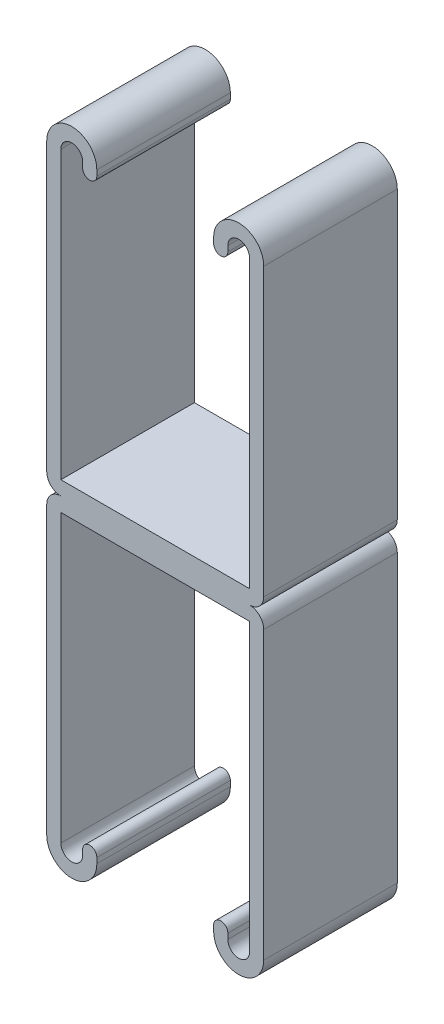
ISO-10303-21;
HEADER;
FILE_DESCRIPTION(('STEP AP214'),'2;1');
FILE_NAME('part.step','',(''),(''),'','','');
FILE_SCHEMA(('AUTOMOTIVE_DESIGN { 1 0 10303 214 1 1 1 1 }'));
ENDSEC;
DATA;
#1=APPLICATION_CONTEXT('core data for automotive mechanical design processes');
#2=APPLICATION_PROTOCOL_DEFINITION('international standard','automotive_design',2000,#1);
#3=PRODUCT_CONTEXT('',#1,'mechanical');
#4=PRODUCT('Part','Part','',(#3));
#5=PRODUCT_RELATED_PRODUCT_CATEGORY('part','',(#4));
#6=PRODUCT_DEFINITION_FORMATION('','',#4);
#7=PRODUCT_DEFINITION_CONTEXT('part definition',#1,'design');
#8=PRODUCT_DEFINITION('design','',#6,#7);
#9=PRODUCT_DEFINITION_SHAPE('','',#8);
#10=(LENGTH_UNIT() NAMED_UNIT(*) SI_UNIT(.MILLI.,.METRE.));
#11=(NAMED_UNIT(*) PLANE_ANGLE_UNIT() SI_UNIT($,.RADIAN.));
#12=(NAMED_UNIT(*) SI_UNIT($,.STERADIAN.) SOLID_ANGLE_UNIT());
#13=UNCERTAINTY_MEASURE_WITH_UNIT(LENGTH_MEASURE(1.E-05),#10,'distance_accuracy_value','');
#14=(GEOMETRIC_REPRESENTATION_CONTEXT(3) GLOBAL_UNCERTAINTY_ASSIGNED_CONTEXT((#13)) GLOBAL_UNIT_ASSIGNED_CONTEXT((#10,
#11,#12)) REPRESENTATION_CONTEXT('',''));
#15=CARTESIAN_POINT('',(0.,0.,0.));
#16=DIRECTION('',(0.,0.,1.));
#17=DIRECTION('',(1.,0.,0.));
#18=AXIS2_PLACEMENT_3D('',#15,#16,#17);
#19=CARTESIAN_POINT('',(-15.875,57.15,12.7));
#20=DIRECTION('',(0.,0.,-1.));
#21=DIRECTION('',(-1.,0.,0.));
#22=AXIS2_PLACEMENT_3D('',#19,#20,#21);
#23=CYLINDRICAL_SURFACE('',#22,4.7625);
#24=CARTESIAN_POINT('',(-15.875,57.15,-12.7));
#25=DIRECTION('',(0.,0.,1.));
#26=DIRECTION('',(-1.,0.,0.));
#27=AXIS2_PLACEMENT_3D('',#24,#25,#26);
#28=CIRCLE('',#27,4.7625);
#29=CARTESIAN_POINT('',(-11.1125,57.15,-12.7));
#30=VERTEX_POINT('',#29);
#31=CARTESIAN_POINT('',(-20.6375,57.15,-12.7));
#32=VERTEX_POINT('',#31);
#33=EDGE_CURVE('E189',#30,#32,#28,.T.);
#34=ORIENTED_EDGE('',*,*,#33,.T.);
#35=DIRECTION('',(0.,0.,-1.));
#36=VECTOR('',#35,1.);
#37=CARTESIAN_POINT('',(-20.6375,57.15,12.7));
#38=LINE('',#37,#36);
#39=CARTESIAN_POINT('',(-20.6375,57.15,12.7));
#40=VERTEX_POINT('',#39);
#41=EDGE_CURVE('E11',#40,#32,#38,.T.);
#42=ORIENTED_EDGE('',*,*,#41,.F.);
#43=CARTESIAN_POINT('',(-15.875,57.15,12.7));
#44=DIRECTION('',(0.,0.,1.));
#45=DIRECTION('',(-1.,0.,0.));
#46=AXIS2_PLACEMENT_3D('',#43,#44,#45);
#47=CIRCLE('',#46,4.7625);
#48=CARTESIAN_POINT('',(-11.1125,57.15,12.7));
#49=VERTEX_POINT('',#48);
#50=EDGE_CURVE('E222',#49,#40,#47,.T.);
#51=ORIENTED_EDGE('',*,*,#50,.F.);
#52=DIRECTION('',(0.,0.,-1.));
#53=VECTOR('',#52,1.);
#54=CARTESIAN_POINT('',(-11.1125,57.15,12.7));
#55=LINE('',#54,#53);
#56=EDGE_CURVE('E185',#49,#30,#55,.T.);
#57=ORIENTED_EDGE('',*,*,#56,.T.);
#58=EDGE_LOOP('',(#34,#42,#51,#57));
#59=FACE_BOUND('',#58,.T.);
#60=ADVANCED_FACE('F32',(#59),#23,.T.);
#61=CARTESIAN_POINT('',(-20.6375,57.15,12.7));
#62=DIRECTION('',(1.,0.,0.));
#63=DIRECTION('',(0.,1.,0.));
#64=AXIS2_PLACEMENT_3D('',#61,#62,#63);
#65=PLANE('',#64);
#66=DIRECTION('',(0.,-1.,0.));
#67=VECTOR('',#66,1.);
#68=CARTESIAN_POINT('',(-20.6375,57.15,-12.7));
#69=LINE('',#68,#67);
#70=CARTESIAN_POINT('',(-20.6375,2.6924,-12.7));
#71=VERTEX_POINT('',#70);
#72=EDGE_CURVE('E192',#32,#71,#69,.T.);
#73=ORIENTED_EDGE('',*,*,#72,.T.);
#74=DIRECTION('',(0.,0.,-1.));
#75=VECTOR('',#74,1.);
#76=CARTESIAN_POINT('',(-20.6375,2.6924,12.7));
#77=LINE('',#76,#75);
#78=CARTESIAN_POINT('',(-20.6375,2.6924,12.7));
#79=VERTEX_POINT('',#78);
#80=EDGE_CURVE('E40',#79,#71,#77,.T.);
#81=ORIENTED_EDGE('',*,*,#80,.F.);
#82=DIRECTION('',(0.,-1.,0.));
#83=VECTOR('',#82,1.);
#84=CARTESIAN_POINT('',(-20.6375,57.15,12.7));
#85=LINE('',#84,#83);
#86=EDGE_CURVE('E119',#40,#79,#85,.T.);
#87=ORIENTED_EDGE('',*,*,#86,.F.);
#88=ORIENTED_EDGE('',*,*,#41,.T.);
#89=EDGE_LOOP('',(#73,#81,#87,#88));
#90=FACE_BOUND('',#89,.T.);
#91=ADVANCED_FACE('F384',(#90),#65,.F.);
#92=CARTESIAN_POINT('',(-17.9451,2.6924,12.7));
#93=DIRECTION('',(0.,0.,-1.));
#94=DIRECTION('',(-1.,0.,0.));
#95=AXIS2_PLACEMENT_3D('',#92,#93,#94);
#96=CYLINDRICAL_SURFACE('',#95,2.6924);
#97=CARTESIAN_POINT('',(-17.9451,2.6924,-12.7));
#98=DIRECTION('',(0.,0.,1.));
#99=DIRECTION('',(-1.,0.,0.));
#100=AXIS2_PLACEMENT_3D('',#97,#98,#99);
#101=CIRCLE('',#100,2.6924);
#102=CARTESIAN_POINT('',(-17.9451,0.,-12.7));
#103=VERTEX_POINT('',#102);
#104=EDGE_CURVE('E195',#71,#103,#101,.T.);
#105=ORIENTED_EDGE('',*,*,#104,.T.);
#106=DIRECTION('',(0.,0.,-1.));
#107=VECTOR('',#106,1.);
#108=CARTESIAN_POINT('',(-17.9451,0.,12.7));
#109=LINE('',#108,#107);
#110=CARTESIAN_POINT('',(-17.9451,0.,12.7));
#111=VERTEX_POINT('',#110);
#112=EDGE_CURVE('E259',#111,#103,#109,.T.);
#113=ORIENTED_EDGE('',*,*,#112,.F.);
#114=CARTESIAN_POINT('',(-17.9451,2.6924,12.7));
#115=DIRECTION('',(0.,0.,1.));
#116=DIRECTION('',(-1.,0.,0.));
#117=AXIS2_PLACEMENT_3D('',#114,#115,#116);
#118=CIRCLE('',#117,2.6924);
#119=EDGE_CURVE('E267',#79,#111,#118,.T.);
#120=ORIENTED_EDGE('',*,*,#119,.F.);
#121=ORIENTED_EDGE('',*,*,#80,.T.);
#122=EDGE_LOOP('',(#105,#113,#120,#121));
#123=FACE_BOUND('',#122,.T.);
#124=ADVANCED_FACE('F265',(#123),#96,.T.);
#125=CARTESIAN_POINT('',(17.9451,2.69240000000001,12.7));
#126=DIRECTION('',(0.,0.,-1.));
#127=DIRECTION('',(-1.,0.,0.));
#128=AXIS2_PLACEMENT_3D('',#125,#126,#127);
#129=CYLINDRICAL_SURFACE('',#128,2.6924);
#130=CARTESIAN_POINT('',(17.9451,2.69240000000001,-12.7));
#131=DIRECTION('',(0.,0.,1.));
#132=DIRECTION('',(1.,0.,0.));
#133=AXIS2_PLACEMENT_3D('',#130,#131,#132);
#134=CIRCLE('',#133,2.6924);
#135=CARTESIAN_POINT('',(17.9451,0.,-12.7));
#136=VERTEX_POINT('',#135);
#137=CARTESIAN_POINT('',(20.6375,2.69240000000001,-12.7));
#138=VERTEX_POINT('',#137);
#139=EDGE_CURVE('E197',#136,#138,#134,.T.);
#140=ORIENTED_EDGE('',*,*,#139,.T.);
#141=DIRECTION('',(0.,0.,-1.));
#142=VECTOR('',#141,1.);
#143=CARTESIAN_POINT('',(20.6375,2.69240000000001,12.7));
#144=LINE('',#143,#142);
#145=CARTESIAN_POINT('',(20.6375,2.69240000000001,12.7));
#146=VERTEX_POINT('',#145);
#147=EDGE_CURVE('E253',#146,#138,#144,.T.);
#148=ORIENTED_EDGE('',*,*,#147,.F.);
#149=CARTESIAN_POINT('',(17.9451,2.69240000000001,12.7));
#150=DIRECTION('',(0.,0.,1.));
#151=DIRECTION('',(1.,0.,0.));
#152=AXIS2_PLACEMENT_3D('',#149,#150,#151);
#153=CIRCLE('',#152,2.6924);
#154=CARTESIAN_POINT('',(17.9451,0.,12.7));
#155=VERTEX_POINT('',#154);
#156=EDGE_CURVE('E341',#155,#146,#153,.T.);
#157=ORIENTED_EDGE('',*,*,#156,.F.);
#158=DIRECTION('',(0.,0.,-1.));
#159=VECTOR('',#158,1.);
#160=CARTESIAN_POINT('',(17.9451,0.,12.7));
#161=LINE('',#160,#159);
#162=EDGE_CURVE('E256',#155,#136,#161,.T.);
#163=ORIENTED_EDGE('',*,*,#162,.T.);
#164=EDGE_LOOP('',(#140,#148,#157,#163));
#165=FACE_BOUND('',#164,.T.);
#166=ADVANCED_FACE('F391',(#165),#129,.T.);
#167=CARTESIAN_POINT('',(20.6375,2.69240000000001,12.7));
#168=DIRECTION('',(-1.,0.,0.));
#169=DIRECTION('',(0.,-1.,0.));
#170=AXIS2_PLACEMENT_3D('',#167,#168,#169);
#171=PLANE('',#170);
#172=DIRECTION('',(0.,1.,0.));
#173=VECTOR('',#172,1.);
#174=CARTESIAN_POINT('',(20.6375,2.69240000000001,-12.7));
#175=LINE('',#174,#173);
#176=CARTESIAN_POINT('',(20.6375,57.15,-12.7));
#177=VERTEX_POINT('',#176);
#178=EDGE_CURVE('E199',#138,#177,#175,.T.);
#179=ORIENTED_EDGE('',*,*,#178,.T.);
#180=DIRECTION('',(0.,0.,-1.));
#181=VECTOR('',#180,1.);
#182=CARTESIAN_POINT('',(20.6375,57.15,12.7));
#183=LINE('',#182,#181);
#184=CARTESIAN_POINT('',(20.6375,57.15,12.7));
#185=VERTEX_POINT('',#184);
#186=EDGE_CURVE('E250',#185,#177,#183,.T.);
#187=ORIENTED_EDGE('',*,*,#186,.F.);
#188=DIRECTION('',(0.,1.,0.));
#189=VECTOR('',#188,1.);
#190=CARTESIAN_POINT('',(20.6375,2.69240000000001,12.7));
#191=LINE('',#190,#189);
#192=EDGE_CURVE('E343',#146,#185,#191,.T.);
#193=ORIENTED_EDGE('',*,*,#192,.F.);
#194=ORIENTED_EDGE('',*,*,#147,.T.);
#195=EDGE_LOOP('',(#179,#187,#193,#194));
#196=FACE_BOUND('',#195,.T.);
#197=ADVANCED_FACE('F396',(#196),#171,.F.);
#198=CARTESIAN_POINT('',(15.875,57.15,12.7));
#199=DIRECTION('',(0.,0.,-1.));
#200=DIRECTION('',(-1.,0.,0.));
#201=AXIS2_PLACEMENT_3D('',#198,#199,#200);
#202=CYLINDRICAL_SURFACE('',#201,4.76250000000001);
#203=CARTESIAN_POINT('',(15.875,57.15,-12.7));
#204=DIRECTION('',(0.,0.,1.));
#205=DIRECTION('',(1.,0.,0.));
#206=AXIS2_PLACEMENT_3D('',#203,#204,#205);
#207=CIRCLE('',#206,4.76250000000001);
#208=CARTESIAN_POINT('',(11.1125,57.15,-12.7));
#209=VERTEX_POINT('',#208);
#210=EDGE_CURVE('E201',#177,#209,#207,.T.);
#211=ORIENTED_EDGE('',*,*,#210,.T.);
#212=DIRECTION('',(0.,0.,-1.));
#213=VECTOR('',#212,1.);
#214=CARTESIAN_POINT('',(11.1125,57.15,12.7));
#215=LINE('',#214,#213);
#216=CARTESIAN_POINT('',(11.1125,57.15,12.7));
#217=VERTEX_POINT('',#216);
#218=EDGE_CURVE('E247',#217,#209,#215,.T.);
#219=ORIENTED_EDGE('',*,*,#218,.F.);
#220=CARTESIAN_POINT('',(15.875,57.15,12.7));
#221=DIRECTION('',(0.,0.,1.));
#222=DIRECTION('',(1.,0.,0.));
#223=AXIS2_PLACEMENT_3D('',#220,#221,#222);
#224=CIRCLE('',#223,4.76250000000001);
#225=EDGE_CURVE('E345',#185,#217,#224,.T.);
#226=ORIENTED_EDGE('',*,*,#225,.F.);
#227=ORIENTED_EDGE('',*,*,#186,.T.);
#228=EDGE_LOOP('',(#211,#219,#226,#227));
#229=FACE_BOUND('',#228,.T.);
#230=ADVANCED_FACE('F400',(#229),#202,.T.);
#231=CARTESIAN_POINT('',(11.1125,57.15,12.7));
#232=DIRECTION('',(1.,0.,0.));
#233=DIRECTION('',(0.,0.,-1.));
#234=AXIS2_PLACEMENT_3D('',#231,#232,#233);
#235=PLANE('',#234);
#236=DIRECTION('',(0.,-1.,0.));
#237=VECTOR('',#236,1.);
#238=CARTESIAN_POINT('',(11.1125,57.15,-12.7));
#239=LINE('',#238,#237);
#240=CARTESIAN_POINT('',(11.1125,56.11495,-12.7));
#241=VERTEX_POINT('',#240);
#242=EDGE_CURVE('E203',#209,#241,#239,.T.);
#243=ORIENTED_EDGE('',*,*,#242,.T.);
#244=DIRECTION('',(0.,0.,-1.));
#245=VECTOR('',#244,1.);
#246=CARTESIAN_POINT('',(11.1125,56.11495,12.7));
#247=LINE('',#246,#245);
#248=CARTESIAN_POINT('',(11.1125,56.11495,12.7));
#249=VERTEX_POINT('',#248);
#250=EDGE_CURVE('E244',#249,#241,#247,.T.);
#251=ORIENTED_EDGE('',*,*,#250,.F.);
#252=DIRECTION('',(0.,-1.,0.));
#253=VECTOR('',#252,1.);
#254=CARTESIAN_POINT('',(11.1125,57.15,12.7));
#255=LINE('',#254,#253);
#256=EDGE_CURVE('E347',#217,#249,#255,.T.);
#257=ORIENTED_EDGE('',*,*,#256,.F.);
#258=ORIENTED_EDGE('',*,*,#218,.T.);
#259=EDGE_LOOP('',(#243,#251,#257,#258));
#260=FACE_BOUND('',#259,.T.);
#261=ADVANCED_FACE('F404',(#260),#235,.F.);
#262=CARTESIAN_POINT('',(12.4587,56.11495,12.7));
#263=DIRECTION('',(0.,0.,-1.));
#264=DIRECTION('',(-1.,0.,0.));
#265=AXIS2_PLACEMENT_3D('',#262,#263,#264);
#266=CYLINDRICAL_SURFACE('',#265,1.3462);
#267=CARTESIAN_POINT('',(12.4587,56.11495,-12.7));
#268=DIRECTION('',(0.,0.,1.));
#269=DIRECTION('',(1.,0.,0.));
#270=AXIS2_PLACEMENT_3D('',#267,#268,#269);
#271=CIRCLE('',#270,1.3462);
#272=CARTESIAN_POINT('',(13.8049,56.11495,-12.7));
#273=VERTEX_POINT('',#272);
#274=EDGE_CURVE('E205',#241,#273,#271,.T.);
#275=ORIENTED_EDGE('',*,*,#274,.T.);
#276=DIRECTION('',(0.,0.,-1.));
#277=VECTOR('',#276,1.);
#278=CARTESIAN_POINT('',(13.8049,56.11495,12.7));
#279=LINE('',#278,#277);
#280=CARTESIAN_POINT('',(13.8049,56.11495,12.7));
#281=VERTEX_POINT('',#280);
#282=EDGE_CURVE('E241',#281,#273,#279,.T.);
#283=ORIENTED_EDGE('',*,*,#282,.F.);
#284=CARTESIAN_POINT('',(12.4587,56.11495,12.7));
#285=DIRECTION('',(0.,0.,1.));
#286=DIRECTION('',(1.,0.,0.));
#287=AXIS2_PLACEMENT_3D('',#284,#285,#286);
#288=CIRCLE('',#287,1.3462);
#289=EDGE_CURVE('E349',#249,#281,#288,.T.);
#290=ORIENTED_EDGE('',*,*,#289,.F.);
#291=ORIENTED_EDGE('',*,*,#250,.T.);
#292=EDGE_LOOP('',(#275,#283,#290,#291));
#293=FACE_BOUND('',#292,.T.);
#294=ADVANCED_FACE('F408',(#293),#266,.T.);
#295=CARTESIAN_POINT('',(13.8049,57.15,12.7));
#296=DIRECTION('',(-1.,0.,0.));
#297=DIRECTION('',(0.,0.,1.));
#298=AXIS2_PLACEMENT_3D('',#295,#296,#297);
#299=PLANE('',#298);
#300=DIRECTION('',(0.,1.,0.));
#301=VECTOR('',#300,1.);
#302=CARTESIAN_POINT('',(13.8049,57.15,-12.7));
#303=LINE('',#302,#301);
#304=CARTESIAN_POINT('',(13.8049,57.15,-12.7));
#305=VERTEX_POINT('',#304);
#306=EDGE_CURVE('E207',#273,#305,#303,.T.);
#307=ORIENTED_EDGE('',*,*,#306,.T.);
#308=DIRECTION('',(0.,0.,-1.));
#309=VECTOR('',#308,1.);
#310=CARTESIAN_POINT('',(13.8049,57.15,12.7));
#311=LINE('',#310,#309);
#312=CARTESIAN_POINT('',(13.8049,57.15,12.7));
#313=VERTEX_POINT('',#312);
#314=EDGE_CURVE('E238',#313,#305,#311,.T.);
#315=ORIENTED_EDGE('',*,*,#314,.F.);
#316=DIRECTION('',(0.,1.,0.));
#317=VECTOR('',#316,1.);
#318=CARTESIAN_POINT('',(13.8049,57.15,12.7));
#319=LINE('',#318,#317);
#320=EDGE_CURVE('E351',#281,#313,#319,.T.);
#321=ORIENTED_EDGE('',*,*,#320,.F.);
#322=ORIENTED_EDGE('',*,*,#282,.T.);
#323=EDGE_LOOP('',(#307,#315,#321,#322));
#324=FACE_BOUND('',#323,.T.);
#325=ADVANCED_FACE('F412',(#324),#299,.F.);
#326=CARTESIAN_POINT('',(15.875,57.15,12.7));
#327=DIRECTION('',(0.,0.,-1.));
#328=DIRECTION('',(-1.,0.,0.));
#329=AXIS2_PLACEMENT_3D('',#326,#327,#328);
#330=CYLINDRICAL_SURFACE('',#329,2.07010000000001);
#331=CARTESIAN_POINT('',(15.875,57.15,-12.7));
#332=DIRECTION('',(0.,0.,-1.));
#333=DIRECTION('',(1.,0.,0.));
#334=AXIS2_PLACEMENT_3D('',#331,#332,#333);
#335=CIRCLE('',#334,2.07010000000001);
#336=CARTESIAN_POINT('',(17.9451,57.15,-12.7));
#337=VERTEX_POINT('',#336);
#338=EDGE_CURVE('E209',#305,#337,#335,.T.);
#339=ORIENTED_EDGE('',*,*,#338,.T.);
#340=DIRECTION('',(0.,0.,-1.));
#341=VECTOR('',#340,1.);
#342=CARTESIAN_POINT('',(17.9451,57.15,12.7));
#343=LINE('',#342,#341);
#344=CARTESIAN_POINT('',(17.9451,57.15,12.7));
#345=VERTEX_POINT('',#344);
#346=EDGE_CURVE('E235',#345,#337,#343,.T.);
#347=ORIENTED_EDGE('',*,*,#346,.F.);
#348=CARTESIAN_POINT('',(15.875,57.15,12.7));
#349=DIRECTION('',(0.,0.,-1.));
#350=DIRECTION('',(1.,0.,0.));
#351=AXIS2_PLACEMENT_3D('',#348,#349,#350);
#352=CIRCLE('',#351,2.07010000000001);
#353=EDGE_CURVE('E353',#313,#345,#352,.T.);
#354=ORIENTED_EDGE('',*,*,#353,.F.);
#355=ORIENTED_EDGE('',*,*,#314,.T.);
#356=EDGE_LOOP('',(#339,#347,#354,#355));
#357=FACE_BOUND('',#356,.T.);
#358=ADVANCED_FACE('F416',(#357),#330,.F.);
#359=CARTESIAN_POINT('',(17.9451,2.6924,12.7));
#360=DIRECTION('',(1.,0.,0.));
#361=DIRECTION('',(0.,0.,-1.));
#362=AXIS2_PLACEMENT_3D('',#359,#360,#361);
#363=PLANE('',#362);
#364=DIRECTION('',(0.,-1.,0.));
#365=VECTOR('',#364,1.);
#366=CARTESIAN_POINT('',(17.9451,2.6924,-12.7));
#367=LINE('',#366,#365);
#368=CARTESIAN_POINT('',(17.9451,2.6924,-12.7));
#369=VERTEX_POINT('',#368);
#370=EDGE_CURVE('E211',#337,#369,#367,.T.);
#371=ORIENTED_EDGE('',*,*,#370,.T.);
#372=DIRECTION('',(0.,0.,-1.));
#373=VECTOR('',#372,1.);
#374=CARTESIAN_POINT('',(17.9451,2.6924,12.7));
#375=LINE('',#374,#373);
#376=CARTESIAN_POINT('',(17.9451,2.6924,12.7));
#377=VERTEX_POINT('',#376);
#378=EDGE_CURVE('E232',#377,#369,#375,.T.);
#379=ORIENTED_EDGE('',*,*,#378,.F.);
#380=DIRECTION('',(0.,-1.,0.));
#381=VECTOR('',#380,1.);
#382=CARTESIAN_POINT('',(17.9451,2.6924,12.7));
#383=LINE('',#382,#381);
#384=EDGE_CURVE('E355',#345,#377,#383,.T.);
#385=ORIENTED_EDGE('',*,*,#384,.F.);
#386=ORIENTED_EDGE('',*,*,#346,.T.);
#387=EDGE_LOOP('',(#371,#379,#385,#386));
#388=FACE_BOUND('',#387,.T.);
#389=ADVANCED_FACE('F420',(#388),#363,.F.);
#390=CARTESIAN_POINT('',(-17.9451,2.6924,12.7));
#391=DIRECTION('',(0.,-1.,0.));
#392=DIRECTION('',(0.,0.,-1.));
#393=AXIS2_PLACEMENT_3D('',#390,#391,#392);
#394=PLANE('',#393);
#395=DIRECTION('',(-1.,0.,0.));
#396=VECTOR('',#395,1.);
#397=CARTESIAN_POINT('',(-17.9451,2.6924,-12.7));
#398=LINE('',#397,#396);
#399=CARTESIAN_POINT('',(-17.9451,2.6924,-12.7));
#400=VERTEX_POINT('',#399);
#401=EDGE_CURVE('E213',#369,#400,#398,.T.);
#402=ORIENTED_EDGE('',*,*,#401,.T.);
#403=DIRECTION('',(0.,0.,-1.));
#404=VECTOR('',#403,1.);
#405=CARTESIAN_POINT('',(-17.9451,2.6924,12.7));
#406=LINE('',#405,#404);
#407=CARTESIAN_POINT('',(-17.9451,2.6924,12.7));
#408=VERTEX_POINT('',#407);
#409=EDGE_CURVE('E229',#408,#400,#406,.T.);
#410=ORIENTED_EDGE('',*,*,#409,.F.);
#411=DIRECTION('',(-1.,0.,0.));
#412=VECTOR('',#411,1.);
#413=CARTESIAN_POINT('',(-17.9451,2.6924,12.7));
#414=LINE('',#413,#412);
#415=EDGE_CURVE('E357',#377,#408,#414,.T.);
#416=ORIENTED_EDGE('',*,*,#415,.F.);
#417=ORIENTED_EDGE('',*,*,#378,.T.);
#418=EDGE_LOOP('',(#402,#410,#416,#417));
#419=FACE_BOUND('',#418,.T.);
#420=ADVANCED_FACE('F424',(#419),#394,.F.);
#421=CARTESIAN_POINT('',(-17.9451,57.15,12.7));
#422=DIRECTION('',(-1.,0.,0.));
#423=DIRECTION('',(0.,-1.,0.));
#424=AXIS2_PLACEMENT_3D('',#421,#422,#423);
#425=PLANE('',#424);
#426=DIRECTION('',(0.,1.,0.));
#427=VECTOR('',#426,1.);
#428=CARTESIAN_POINT('',(-17.9451,57.15,-12.7));
#429=LINE('',#428,#427);
#430=CARTESIAN_POINT('',(-17.9451,57.15,-12.7));
#431=VERTEX_POINT('',#430);
#432=EDGE_CURVE('E215',#400,#431,#429,.T.);
#433=ORIENTED_EDGE('',*,*,#432,.T.);
#434=DIRECTION('',(0.,0.,-1.));
#435=VECTOR('',#434,1.);
#436=CARTESIAN_POINT('',(-17.9451,57.15,12.7));
#437=LINE('',#436,#435);
#438=CARTESIAN_POINT('',(-17.9451,57.15,12.7));
#439=VERTEX_POINT('',#438);
#440=EDGE_CURVE('E226',#439,#431,#437,.T.);
#441=ORIENTED_EDGE('',*,*,#440,.F.);
#442=DIRECTION('',(0.,1.,0.));
#443=VECTOR('',#442,1.);
#444=CARTESIAN_POINT('',(-17.9451,57.15,12.7));
#445=LINE('',#444,#443);
#446=EDGE_CURVE('E359',#408,#439,#445,.T.);
#447=ORIENTED_EDGE('',*,*,#446,.F.);
#448=ORIENTED_EDGE('',*,*,#409,.T.);
#449=EDGE_LOOP('',(#433,#441,#447,#448));
#450=FACE_BOUND('',#449,.T.);
#451=ADVANCED_FACE('F365',(#450),#425,.F.);
#452=CARTESIAN_POINT('',(-15.875,57.15,12.7));
#453=DIRECTION('',(0.,0.,-1.));
#454=DIRECTION('',(-1.,0.,0.));
#455=AXIS2_PLACEMENT_3D('',#452,#453,#454);
#456=CYLINDRICAL_SURFACE('',#455,2.0701);
#457=CARTESIAN_POINT('',(-15.875,57.15,-12.7));
#458=DIRECTION('',(0.,0.,-1.));
#459=DIRECTION('',(-1.,0.,0.));
#460=AXIS2_PLACEMENT_3D('',#457,#458,#459);
#461=CIRCLE('',#460,2.0701);
#462=CARTESIAN_POINT('',(-13.8049,57.15,-12.7));
#463=VERTEX_POINT('',#462);
#464=EDGE_CURVE('E217',#431,#463,#461,.T.);
#465=ORIENTED_EDGE('',*,*,#464,.T.);
#466=DIRECTION('',(0.,0.,-1.));
#467=VECTOR('',#466,1.);
#468=CARTESIAN_POINT('',(-13.8049,57.15,12.7));
#469=LINE('',#468,#467);
#470=CARTESIAN_POINT('',(-13.8049,57.15,12.7));
#471=VERTEX_POINT('',#470);
#472=EDGE_CURVE('E180',#471,#463,#469,.T.);
#473=ORIENTED_EDGE('',*,*,#472,.F.);
#474=CARTESIAN_POINT('',(-15.875,57.15,12.7));
#475=DIRECTION('',(0.,0.,-1.));
#476=DIRECTION('',(-1.,0.,0.));
#477=AXIS2_PLACEMENT_3D('',#474,#475,#476);
#478=CIRCLE('',#477,2.0701);
#479=EDGE_CURVE('E171',#439,#471,#478,.T.);
#480=ORIENTED_EDGE('',*,*,#479,.F.);
#481=ORIENTED_EDGE('',*,*,#440,.T.);
#482=EDGE_LOOP('',(#465,#473,#480,#481));
#483=FACE_BOUND('',#482,.T.);
#484=ADVANCED_FACE('F369',(#483),#456,.F.);
#485=CARTESIAN_POINT('',(-13.8049,57.15,12.7));
#486=DIRECTION('',(1.,0.,0.));
#487=DIRECTION('',(0.,0.,-1.));
#488=AXIS2_PLACEMENT_3D('',#485,#486,#487);
#489=PLANE('',#488);
#490=DIRECTION('',(0.,-1.,0.));
#491=VECTOR('',#490,1.);
#492=CARTESIAN_POINT('',(-13.8049,57.15,-12.7));
#493=LINE('',#492,#491);
#494=CARTESIAN_POINT('',(-13.8049,56.11495,-12.7));
#495=VERTEX_POINT('',#494);
#496=EDGE_CURVE('E179',#463,#495,#493,.T.);
#497=ORIENTED_EDGE('',*,*,#496,.T.);
#498=DIRECTION('',(0.,0.,-1.));
#499=VECTOR('',#498,1.);
#500=CARTESIAN_POINT('',(-13.8049,56.11495,12.7));
#501=LINE('',#500,#499);
#502=CARTESIAN_POINT('',(-13.8049,56.11495,12.7));
#503=VERTEX_POINT('',#502);
#504=EDGE_CURVE('E176',#503,#495,#501,.T.);
#505=ORIENTED_EDGE('',*,*,#504,.F.);
#506=DIRECTION('',(0.,-1.,0.));
#507=VECTOR('',#506,1.);
#508=CARTESIAN_POINT('',(-13.8049,57.15,12.7));
#509=LINE('',#508,#507);
#510=EDGE_CURVE('E165',#471,#503,#509,.T.);
#511=ORIENTED_EDGE('',*,*,#510,.F.);
#512=ORIENTED_EDGE('',*,*,#472,.T.);
#513=EDGE_LOOP('',(#497,#505,#511,#512));
#514=FACE_BOUND('',#513,.T.);
#515=ADVANCED_FACE('F177',(#514),#489,.F.);
#516=CARTESIAN_POINT('',(-12.4587,56.11495,12.7));
#517=DIRECTION('',(0.,0.,-1.));
#518=DIRECTION('',(-1.,0.,0.));
#519=AXIS2_PLACEMENT_3D('',#516,#517,#518);
#520=CYLINDRICAL_SURFACE('',#519,1.3462);
#521=CARTESIAN_POINT('',(-12.4587,56.11495,-12.7));
#522=DIRECTION('',(0.,0.,1.));
#523=DIRECTION('',(-1.,0.,0.));
#524=AXIS2_PLACEMENT_3D('',#521,#522,#523);
#525=CIRCLE('',#524,1.3462);
#526=CARTESIAN_POINT('',(-11.1125,56.11495,-12.7));
#527=VERTEX_POINT('',#526);
#528=EDGE_CURVE('E105',#495,#527,#525,.T.);
#529=ORIENTED_EDGE('',*,*,#528,.T.);
#530=DIRECTION('',(0.,0.,-1.));
#531=VECTOR('',#530,1.);
#532=CARTESIAN_POINT('',(-11.1125,56.11495,12.7));
#533=LINE('',#532,#531);
#534=CARTESIAN_POINT('',(-11.1125,56.11495,12.7));
#535=VERTEX_POINT('',#534);
#536=EDGE_CURVE('E181',#535,#527,#533,.T.);
#537=ORIENTED_EDGE('',*,*,#536,.F.);
#538=CARTESIAN_POINT('',(-12.4587,56.11495,12.7));
#539=DIRECTION('',(0.,0.,1.));
#540=DIRECTION('',(-1.,0.,0.));
#541=AXIS2_PLACEMENT_3D('',#538,#539,#540);
#542=CIRCLE('',#541,1.3462);
#543=EDGE_CURVE('E169',#503,#535,#542,.T.);
#544=ORIENTED_EDGE('',*,*,#543,.F.);
#545=ORIENTED_EDGE('',*,*,#504,.T.);
#546=EDGE_LOOP('',(#529,#537,#544,#545));
#547=FACE_BOUND('',#546,.T.);
#548=ADVANCED_FACE('F183',(#547),#520,.T.);
#549=CARTESIAN_POINT('',(-11.1125,57.15,12.7));
#550=DIRECTION('',(-1.,0.,0.));
#551=DIRECTION('',(0.,0.,1.));
#552=AXIS2_PLACEMENT_3D('',#549,#550,#551);
#553=PLANE('',#552);
#554=DIRECTION('',(0.,1.,0.));
#555=VECTOR('',#554,1.);
#556=CARTESIAN_POINT('',(-11.1125,57.15,-12.7));
#557=LINE('',#556,#555);
#558=EDGE_CURVE('E111',#527,#30,#557,.T.);
#559=ORIENTED_EDGE('',*,*,#558,.T.);
#560=ORIENTED_EDGE('',*,*,#56,.F.);
#561=DIRECTION('',(0.,1.,0.));
#562=VECTOR('',#561,1.);
#563=CARTESIAN_POINT('',(-11.1125,57.15,12.7));
#564=LINE('',#563,#562);
#565=EDGE_CURVE('E48',#535,#49,#564,.T.);
#566=ORIENTED_EDGE('',*,*,#565,.F.);
#567=ORIENTED_EDGE('',*,*,#536,.T.);
#568=EDGE_LOOP('',(#559,#560,#566,#567));
#569=FACE_BOUND('',#568,.T.);
#570=ADVANCED_FACE('F373',(#569),#553,.F.);
#571=CARTESIAN_POINT('',(-15.875,57.15,12.7));
#572=DIRECTION('',(0.,0.,-1.));
#573=DIRECTION('',(-1.,0.,0.));
#574=AXIS2_PLACEMENT_3D('',#571,#572,#573);
#575=PLANE('',#574);
#576=ORIENTED_EDGE('',*,*,#50,.T.);
#577=ORIENTED_EDGE('',*,*,#86,.T.);
#578=ORIENTED_EDGE('',*,*,#119,.T.);
#579=CARTESIAN_POINT('',(-17.9451,-2.6924,12.7));
#580=DIRECTION('',(0.,0.,-1.));
#581=DIRECTION('',(-1.,0.,0.));
#582=AXIS2_PLACEMENT_3D('',#579,#580,#581);
#583=CIRCLE('',#582,2.6924);
#584=CARTESIAN_POINT('',(-20.6375,-2.6924,12.7));
#585=VERTEX_POINT('',#584);
#586=EDGE_CURVE('E782',#585,#111,#583,.T.);
#587=ORIENTED_EDGE('',*,*,#586,.F.);
#588=DIRECTION('',(0.,1.,0.));
#589=VECTOR('',#588,1.);
#590=CARTESIAN_POINT('',(-20.6375,-57.15,12.7));
#591=LINE('',#590,#589);
#592=CARTESIAN_POINT('',(-20.6375,-57.15,12.7));
#593=VERTEX_POINT('',#592);
#594=EDGE_CURVE('E294',#593,#585,#591,.T.);
#595=ORIENTED_EDGE('',*,*,#594,.F.);
#596=CARTESIAN_POINT('',(-15.875,-57.15,12.7));
#597=DIRECTION('',(0.,0.,-1.));
#598=DIRECTION('',(-1.,0.,0.));
#599=AXIS2_PLACEMENT_3D('',#596,#597,#598);
#600=CIRCLE('',#599,4.7625);
#601=CARTESIAN_POINT('',(-11.1125,-57.15,12.7));
#602=VERTEX_POINT('',#601);
#603=EDGE_CURVE('E283',#602,#593,#600,.T.);
#604=ORIENTED_EDGE('',*,*,#603,.F.);
#605=DIRECTION('',(0.,-1.,0.));
#606=VECTOR('',#605,1.);
#607=CARTESIAN_POINT('',(-11.1125,-57.15,12.7));
#608=LINE('',#607,#606);
#609=CARTESIAN_POINT('',(-11.1125,-56.11495,12.7));
#610=VERTEX_POINT('',#609);
#611=EDGE_CURVE('E731',#610,#602,#608,.T.);
#612=ORIENTED_EDGE('',*,*,#611,.F.);
#613=CARTESIAN_POINT('',(-12.4587,-56.11495,12.7));
#614=DIRECTION('',(0.,0.,-1.));
#615=DIRECTION('',(-1.,0.,0.));
#616=AXIS2_PLACEMENT_3D('',#613,#614,#615);
#617=CIRCLE('',#616,1.3462);
#618=CARTESIAN_POINT('',(-13.8049,-56.11495,12.7));
#619=VERTEX_POINT('',#618);
#620=EDGE_CURVE('E740',#619,#610,#617,.T.);
#621=ORIENTED_EDGE('',*,*,#620,.F.);
#622=DIRECTION('',(0.,1.,0.));
#623=VECTOR('',#622,1.);
#624=CARTESIAN_POINT('',(-13.8049,-57.15,12.7));
#625=LINE('',#624,#623);
#626=CARTESIAN_POINT('',(-13.8049,-57.15,12.7));
#627=VERTEX_POINT('',#626);
#628=EDGE_CURVE('E744',#627,#619,#625,.T.);
#629=ORIENTED_EDGE('',*,*,#628,.F.);
#630=CARTESIAN_POINT('',(-15.875,-57.15,12.7));
#631=DIRECTION('',(0.,0.,1.));
#632=DIRECTION('',(-1.,0.,0.));
#633=AXIS2_PLACEMENT_3D('',#630,#631,#632);
#634=CIRCLE('',#633,2.0701);
#635=CARTESIAN_POINT('',(-17.9451,-57.15,12.7));
#636=VERTEX_POINT('',#635);
#637=EDGE_CURVE('E746',#636,#627,#634,.T.);
#638=ORIENTED_EDGE('',*,*,#637,.F.);
#639=DIRECTION('',(0.,-1.,0.));
#640=VECTOR('',#639,1.);
#641=CARTESIAN_POINT('',(-17.9451,-57.15,12.7));
#642=LINE('',#641,#640);
#643=CARTESIAN_POINT('',(-17.9451,-2.6924,12.7));
#644=VERTEX_POINT('',#643);
#645=EDGE_CURVE('E752',#644,#636,#642,.T.);
#646=ORIENTED_EDGE('',*,*,#645,.F.);
#647=DIRECTION('',(-1.,0.,0.));
#648=VECTOR('',#647,1.);
#649=CARTESIAN_POINT('',(-17.9451,-2.6924,12.7));
#650=LINE('',#649,#648);
#651=CARTESIAN_POINT('',(17.9451,-2.6924,12.7));
#652=VERTEX_POINT('',#651);
#653=EDGE_CURVE('E755',#652,#644,#650,.T.);
#654=ORIENTED_EDGE('',*,*,#653,.F.);
#655=DIRECTION('',(0.,1.,0.));
#656=VECTOR('',#655,1.);
#657=CARTESIAN_POINT('',(17.9451,-2.6924,12.7));
#658=LINE('',#657,#656);
#659=CARTESIAN_POINT('',(17.9451,-57.15,12.7));
#660=VERTEX_POINT('',#659);
#661=EDGE_CURVE('E758',#660,#652,#658,.T.);
#662=ORIENTED_EDGE('',*,*,#661,.F.);
#663=CARTESIAN_POINT('',(15.875,-57.15,12.7));
#664=DIRECTION('',(0.,0.,1.));
#665=DIRECTION('',(1.,0.,0.));
#666=AXIS2_PLACEMENT_3D('',#663,#664,#665);
#667=CIRCLE('',#666,2.07010000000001);
#668=CARTESIAN_POINT('',(13.8049,-57.15,12.7));
#669=VERTEX_POINT('',#668);
#670=EDGE_CURVE('E761',#669,#660,#667,.T.);
#671=ORIENTED_EDGE('',*,*,#670,.F.);
#672=DIRECTION('',(0.,-1.,0.));
#673=VECTOR('',#672,1.);
#674=CARTESIAN_POINT('',(13.8049,-57.15,12.7));
#675=LINE('',#674,#673);
#676=CARTESIAN_POINT('',(13.8049,-56.11495,12.7));
#677=VERTEX_POINT('',#676);
#678=EDGE_CURVE('E764',#677,#669,#675,.T.);
#679=ORIENTED_EDGE('',*,*,#678,.F.);
#680=CARTESIAN_POINT('',(12.4587,-56.11495,12.7));
#681=DIRECTION('',(0.,0.,-1.));
#682=DIRECTION('',(1.,0.,0.));
#683=AXIS2_PLACEMENT_3D('',#680,#681,#682);
#684=CIRCLE('',#683,1.3462);
#685=CARTESIAN_POINT('',(11.1125,-56.11495,12.7));
#686=VERTEX_POINT('',#685);
#687=EDGE_CURVE('E767',#686,#677,#684,.T.);
#688=ORIENTED_EDGE('',*,*,#687,.F.);
#689=DIRECTION('',(0.,1.,0.));
#690=VECTOR('',#689,1.);
#691=CARTESIAN_POINT('',(11.1125,-57.15,12.7));
#692=LINE('',#691,#690);
#693=CARTESIAN_POINT('',(11.1125,-57.15,12.7));
#694=VERTEX_POINT('',#693);
#695=EDGE_CURVE('E770',#694,#686,#692,.T.);
#696=ORIENTED_EDGE('',*,*,#695,.F.);
#697=CARTESIAN_POINT('',(15.875,-57.15,12.7));
#698=DIRECTION('',(0.,0.,-1.));
#699=DIRECTION('',(1.,0.,0.));
#700=AXIS2_PLACEMENT_3D('',#697,#698,#699);
#701=CIRCLE('',#700,4.76250000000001);
#702=CARTESIAN_POINT('',(20.6375,-57.15,12.7));
#703=VERTEX_POINT('',#702);
#704=EDGE_CURVE('E773',#703,#694,#701,.T.);
#705=ORIENTED_EDGE('',*,*,#704,.F.);
#706=DIRECTION('',(0.,-1.,0.));
#707=VECTOR('',#706,1.);
#708=CARTESIAN_POINT('',(20.6375,-2.69240000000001,12.7));
#709=LINE('',#708,#707);
#710=CARTESIAN_POINT('',(20.6375,-2.69240000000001,12.7));
#711=VERTEX_POINT('',#710);
#712=EDGE_CURVE('E776',#711,#703,#709,.T.);
#713=ORIENTED_EDGE('',*,*,#712,.F.);
#714=CARTESIAN_POINT('',(17.9451,-2.69240000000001,12.7));
#715=DIRECTION('',(0.,0.,-1.));
#716=DIRECTION('',(1.,0.,0.));
#717=AXIS2_PLACEMENT_3D('',#714,#715,#716);
#718=CIRCLE('',#717,2.6924);
#719=EDGE_CURVE('E779',#155,#711,#718,.T.);
#720=ORIENTED_EDGE('',*,*,#719,.F.);
#721=ORIENTED_EDGE('',*,*,#156,.T.);
#722=ORIENTED_EDGE('',*,*,#192,.T.);
#723=ORIENTED_EDGE('',*,*,#225,.T.);
#724=ORIENTED_EDGE('',*,*,#256,.T.);
#725=ORIENTED_EDGE('',*,*,#289,.T.);
#726=ORIENTED_EDGE('',*,*,#320,.T.);
#727=ORIENTED_EDGE('',*,*,#353,.T.);
#728=ORIENTED_EDGE('',*,*,#384,.T.);
#729=ORIENTED_EDGE('',*,*,#415,.T.);
#730=ORIENTED_EDGE('',*,*,#446,.T.);
#731=ORIENTED_EDGE('',*,*,#479,.T.);
#732=ORIENTED_EDGE('',*,*,#510,.T.);
#733=ORIENTED_EDGE('',*,*,#543,.T.);
#734=ORIENTED_EDGE('',*,*,#565,.T.);
#735=EDGE_LOOP('',(#576,#577,#578,#587,#595,#604,#612,#621,#629,#638,#646,#654,#662,#671,#679,
#688,#696,#705,#713,#720,#721,#722,#723,#724,#725,#726,#727,#728,#729,#730,#731,#732,#733,#734));
#736=FACE_BOUND('',#735,.T.);
#737=ADVANCED_FACE('F167',(#736),#575,.F.);
#738=CARTESIAN_POINT('',(-15.875,57.15,-12.7));
#739=DIRECTION('',(0.,0.,-1.));
#740=DIRECTION('',(-1.,0.,0.));
#741=AXIS2_PLACEMENT_3D('',#738,#739,#740);
#742=PLANE('',#741);
#743=ORIENTED_EDGE('',*,*,#33,.F.);
#744=ORIENTED_EDGE('',*,*,#558,.F.);
#745=ORIENTED_EDGE('',*,*,#528,.F.);
#746=ORIENTED_EDGE('',*,*,#496,.F.);
#747=ORIENTED_EDGE('',*,*,#464,.F.);
#748=ORIENTED_EDGE('',*,*,#432,.F.);
#749=ORIENTED_EDGE('',*,*,#401,.F.);
#750=ORIENTED_EDGE('',*,*,#370,.F.);
#751=ORIENTED_EDGE('',*,*,#338,.F.);
#752=ORIENTED_EDGE('',*,*,#306,.F.);
#753=ORIENTED_EDGE('',*,*,#274,.F.);
#754=ORIENTED_EDGE('',*,*,#242,.F.);
#755=ORIENTED_EDGE('',*,*,#210,.F.);
#756=ORIENTED_EDGE('',*,*,#178,.F.);
#757=ORIENTED_EDGE('',*,*,#139,.F.);
#758=CARTESIAN_POINT('',(17.9451,-2.69240000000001,-12.7));
#759=DIRECTION('',(0.,0.,-1.));
#760=DIRECTION('',(1.,0.,0.));
#761=AXIS2_PLACEMENT_3D('',#758,#759,#760);
#762=CIRCLE('',#761,2.6924);
#763=CARTESIAN_POINT('',(20.6375,-2.69240000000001,-12.7));
#764=VERTEX_POINT('',#763);
#765=EDGE_CURVE('E281',#136,#764,#762,.T.);
#766=ORIENTED_EDGE('',*,*,#765,.T.);
#767=DIRECTION('',(0.,-1.,0.));
#768=VECTOR('',#767,1.);
#769=CARTESIAN_POINT('',(20.6375,-2.69240000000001,-12.7));
#770=LINE('',#769,#768);
#771=CARTESIAN_POINT('',(20.6375,-57.15,-12.7));
#772=VERTEX_POINT('',#771);
#773=EDGE_CURVE('E286',#764,#772,#770,.T.);
#774=ORIENTED_EDGE('',*,*,#773,.T.);
#775=CARTESIAN_POINT('',(15.875,-57.15,-12.7));
#776=DIRECTION('',(0.,0.,-1.));
#777=DIRECTION('',(1.,0.,0.));
#778=AXIS2_PLACEMENT_3D('',#775,#776,#777);
#779=CIRCLE('',#778,4.76250000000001);
#780=CARTESIAN_POINT('',(11.1125,-57.15,-12.7));
#781=VERTEX_POINT('',#780);
#782=EDGE_CURVE('E818',#772,#781,#779,.T.);
#783=ORIENTED_EDGE('',*,*,#782,.T.);
#784=DIRECTION('',(0.,1.,0.));
#785=VECTOR('',#784,1.);
#786=CARTESIAN_POINT('',(11.1125,-57.15,-12.7));
#787=LINE('',#786,#785);
#788=CARTESIAN_POINT('',(11.1125,-56.11495,-12.7));
#789=VERTEX_POINT('',#788);
#790=EDGE_CURVE('E815',#781,#789,#787,.T.);
#791=ORIENTED_EDGE('',*,*,#790,.T.);
#792=CARTESIAN_POINT('',(12.4587,-56.11495,-12.7));
#793=DIRECTION('',(0.,0.,-1.));
#794=DIRECTION('',(1.,0.,0.));
#795=AXIS2_PLACEMENT_3D('',#792,#793,#794);
#796=CIRCLE('',#795,1.3462);
#797=CARTESIAN_POINT('',(13.8049,-56.11495,-12.7));
#798=VERTEX_POINT('',#797);
#799=EDGE_CURVE('E812',#789,#798,#796,.T.);
#800=ORIENTED_EDGE('',*,*,#799,.T.);
#801=DIRECTION('',(0.,-1.,0.));
#802=VECTOR('',#801,1.);
#803=CARTESIAN_POINT('',(13.8049,-57.15,-12.7));
#804=LINE('',#803,#802);
#805=CARTESIAN_POINT('',(13.8049,-57.15,-12.7));
#806=VERTEX_POINT('',#805);
#807=EDGE_CURVE('E809',#798,#806,#804,.T.);
#808=ORIENTED_EDGE('',*,*,#807,.T.);
#809=CARTESIAN_POINT('',(15.875,-57.15,-12.7));
#810=DIRECTION('',(0.,0.,1.));
#811=DIRECTION('',(1.,0.,0.));
#812=AXIS2_PLACEMENT_3D('',#809,#810,#811);
#813=CIRCLE('',#812,2.07010000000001);
#814=CARTESIAN_POINT('',(17.9451,-57.15,-12.7));
#815=VERTEX_POINT('',#814);
#816=EDGE_CURVE('E806',#806,#815,#813,.T.);
#817=ORIENTED_EDGE('',*,*,#816,.T.);
#818=DIRECTION('',(0.,1.,0.));
#819=VECTOR('',#818,1.);
#820=CARTESIAN_POINT('',(17.9451,-2.6924,-12.7));
#821=LINE('',#820,#819);
#822=CARTESIAN_POINT('',(17.9451,-2.6924,-12.7));
#823=VERTEX_POINT('',#822);
#824=EDGE_CURVE('E803',#815,#823,#821,.T.);
#825=ORIENTED_EDGE('',*,*,#824,.T.);
#826=DIRECTION('',(-1.,0.,0.));
#827=VECTOR('',#826,1.);
#828=CARTESIAN_POINT('',(-17.9451,-2.6924,-12.7));
#829=LINE('',#828,#827);
#830=CARTESIAN_POINT('',(-17.9451,-2.6924,-12.7));
#831=VERTEX_POINT('',#830);
#832=EDGE_CURVE('E800',#823,#831,#829,.T.);
#833=ORIENTED_EDGE('',*,*,#832,.T.);
#834=DIRECTION('',(0.,-1.,0.));
#835=VECTOR('',#834,1.);
#836=CARTESIAN_POINT('',(-17.9451,-57.15,-12.7));
#837=LINE('',#836,#835);
#838=CARTESIAN_POINT('',(-17.9451,-57.15,-12.7));
#839=VERTEX_POINT('',#838);
#840=EDGE_CURVE('E797',#831,#839,#837,.T.);
#841=ORIENTED_EDGE('',*,*,#840,.T.);
#842=CARTESIAN_POINT('',(-15.875,-57.15,-12.7));
#843=DIRECTION('',(0.,0.,1.));
#844=DIRECTION('',(-1.,0.,0.));
#845=AXIS2_PLACEMENT_3D('',#842,#843,#844);
#846=CIRCLE('',#845,2.0701);
#847=CARTESIAN_POINT('',(-13.8049,-57.15,-12.7));
#848=VERTEX_POINT('',#847);
#849=EDGE_CURVE('E794',#839,#848,#846,.T.);
#850=ORIENTED_EDGE('',*,*,#849,.T.);
#851=DIRECTION('',(0.,1.,0.));
#852=VECTOR('',#851,1.);
#853=CARTESIAN_POINT('',(-13.8049,-57.15,-12.7));
#854=LINE('',#853,#852);
#855=CARTESIAN_POINT('',(-13.8049,-56.11495,-12.7));
#856=VERTEX_POINT('',#855);
#857=EDGE_CURVE('E791',#848,#856,#854,.T.);
#858=ORIENTED_EDGE('',*,*,#857,.T.);
#859=CARTESIAN_POINT('',(-12.4587,-56.11495,-12.7));
#860=DIRECTION('',(0.,0.,-1.));
#861=DIRECTION('',(-1.,0.,0.));
#862=AXIS2_PLACEMENT_3D('',#859,#860,#861);
#863=CIRCLE('',#862,1.3462);
#864=CARTESIAN_POINT('',(-11.1125,-56.11495,-12.7));
#865=VERTEX_POINT('',#864);
#866=EDGE_CURVE('E789',#856,#865,#863,.T.);
#867=ORIENTED_EDGE('',*,*,#866,.T.);
#868=DIRECTION('',(0.,-1.,0.));
#869=VECTOR('',#868,1.);
#870=CARTESIAN_POINT('',(-11.1125,-57.15,-12.7));
#871=LINE('',#870,#869);
#872=CARTESIAN_POINT('',(-11.1125,-57.15,-12.7));
#873=VERTEX_POINT('',#872);
#874=EDGE_CURVE('E733',#865,#873,#871,.T.);
#875=ORIENTED_EDGE('',*,*,#874,.T.);
#876=CARTESIAN_POINT('',(-15.875,-57.15,-12.7));
#877=DIRECTION('',(0.,0.,-1.));
#878=DIRECTION('',(-1.,0.,0.));
#879=AXIS2_PLACEMENT_3D('',#876,#877,#878);
#880=CIRCLE('',#879,4.7625);
#881=CARTESIAN_POINT('',(-20.6375,-57.15,-12.7));
#882=VERTEX_POINT('',#881);
#883=EDGE_CURVE('E786',#873,#882,#880,.T.);
#884=ORIENTED_EDGE('',*,*,#883,.T.);
#885=DIRECTION('',(0.,1.,0.));
#886=VECTOR('',#885,1.);
#887=CARTESIAN_POINT('',(-20.6375,-57.15,-12.7));
#888=LINE('',#887,#886);
#889=CARTESIAN_POINT('',(-20.6375,-2.6924,-12.7));
#890=VERTEX_POINT('',#889);
#891=EDGE_CURVE('E278',#882,#890,#888,.T.);
#892=ORIENTED_EDGE('',*,*,#891,.T.);
#893=CARTESIAN_POINT('',(-17.9451,-2.6924,-12.7));
#894=DIRECTION('',(0.,0.,-1.));
#895=DIRECTION('',(-1.,0.,0.));
#896=AXIS2_PLACEMENT_3D('',#893,#894,#895);
#897=CIRCLE('',#896,2.6924);
#898=EDGE_CURVE('E274',#890,#103,#897,.T.);
#899=ORIENTED_EDGE('',*,*,#898,.T.);
#900=ORIENTED_EDGE('',*,*,#104,.F.);
#901=ORIENTED_EDGE('',*,*,#72,.F.);
#902=EDGE_LOOP('',(#743,#744,#745,#746,#747,#748,#749,#750,#751,#752,#753,#754,#755,#756,#757,
#766,#774,#783,#791,#800,#808,#817,#825,#833,#841,#850,#858,#867,#875,#884,#892,#899,#900,#901));
#903=FACE_BOUND('',#902,.T.);
#904=ADVANCED_FACE('F271',(#903),#742,.T.);
#905=CARTESIAN_POINT('',(-15.875,-57.15,12.7));
#906=DIRECTION('',(0.,0.,-1.));
#907=DIRECTION('',(-1.,0.,0.));
#908=AXIS2_PLACEMENT_3D('',#905,#906,#907);
#909=CYLINDRICAL_SURFACE('',#908,4.7625);
#910=ORIENTED_EDGE('',*,*,#883,.F.);
#911=DIRECTION('',(0.,0.,-1.));
#912=VECTOR('',#911,1.);
#913=CARTESIAN_POINT('',(-11.1125,-57.15,12.7));
#914=LINE('',#913,#912);
#915=EDGE_CURVE('E193',#602,#873,#914,.T.);
#916=ORIENTED_EDGE('',*,*,#915,.F.);
#917=ORIENTED_EDGE('',*,*,#603,.T.);
#918=DIRECTION('',(0.,0.,-1.));
#919=VECTOR('',#918,1.);
#920=CARTESIAN_POINT('',(-20.6375,-57.15,12.7));
#921=LINE('',#920,#919);
#922=EDGE_CURVE('E290',#593,#882,#921,.T.);
#923=ORIENTED_EDGE('',*,*,#922,.T.);
#924=EDGE_LOOP('',(#910,#916,#917,#923));
#925=FACE_BOUND('',#924,.T.);
#926=ADVANCED_FACE('F477',(#925),#909,.T.);
#927=CARTESIAN_POINT('',(-11.1125,-57.15,12.7));
#928=DIRECTION('',(1.,0.,0.));
#929=DIRECTION('',(0.,0.,-1.));
#930=AXIS2_PLACEMENT_3D('',#927,#928,#929);
#931=PLANE('',#930);
#932=ORIENTED_EDGE('',*,*,#874,.F.);
#933=DIRECTION('',(0.,0.,-1.));
#934=VECTOR('',#933,1.);
#935=CARTESIAN_POINT('',(-11.1125,-56.11495,12.7));
#936=LINE('',#935,#934);
#937=EDGE_CURVE('E333',#610,#865,#936,.T.);
#938=ORIENTED_EDGE('',*,*,#937,.F.);
#939=ORIENTED_EDGE('',*,*,#611,.T.);
#940=ORIENTED_EDGE('',*,*,#915,.T.);
#941=EDGE_LOOP('',(#932,#938,#939,#940));
#942=FACE_BOUND('',#941,.T.);
#943=ADVANCED_FACE('F485',(#942),#931,.T.);
#944=CARTESIAN_POINT('',(-12.4587,-56.11495,12.7));
#945=DIRECTION('',(0.,0.,-1.));
#946=DIRECTION('',(-1.,0.,0.));
#947=AXIS2_PLACEMENT_3D('',#944,#945,#946);
#948=CYLINDRICAL_SURFACE('',#947,1.3462);
#949=ORIENTED_EDGE('',*,*,#866,.F.);
#950=DIRECTION('',(0.,0.,-1.));
#951=VECTOR('',#950,1.);
#952=CARTESIAN_POINT('',(-13.8049,-56.11495,12.7));
#953=LINE('',#952,#951);
#954=EDGE_CURVE('E330',#619,#856,#953,.T.);
#955=ORIENTED_EDGE('',*,*,#954,.F.);
#956=ORIENTED_EDGE('',*,*,#620,.T.);
#957=ORIENTED_EDGE('',*,*,#937,.T.);
#958=EDGE_LOOP('',(#949,#955,#956,#957));
#959=FACE_BOUND('',#958,.T.);
#960=ADVANCED_FACE('F495',(#959),#948,.T.);
#961=CARTESIAN_POINT('',(-13.8049,-57.15,12.7));
#962=DIRECTION('',(-1.,0.,0.));
#963=DIRECTION('',(0.,0.,1.));
#964=AXIS2_PLACEMENT_3D('',#961,#962,#963);
#965=PLANE('',#964);
#966=ORIENTED_EDGE('',*,*,#857,.F.);
#967=DIRECTION('',(0.,0.,-1.));
#968=VECTOR('',#967,1.);
#969=CARTESIAN_POINT('',(-13.8049,-57.15,12.7));
#970=LINE('',#969,#968);
#971=EDGE_CURVE('E327',#627,#848,#970,.T.);
#972=ORIENTED_EDGE('',*,*,#971,.F.);
#973=ORIENTED_EDGE('',*,*,#628,.T.);
#974=ORIENTED_EDGE('',*,*,#954,.T.);
#975=EDGE_LOOP('',(#966,#972,#973,#974));
#976=FACE_BOUND('',#975,.T.);
#977=ADVANCED_FACE('F505',(#976),#965,.T.);
#978=CARTESIAN_POINT('',(-15.875,-57.15,12.7));
#979=DIRECTION('',(0.,0.,-1.));
#980=DIRECTION('',(-1.,0.,0.));
#981=AXIS2_PLACEMENT_3D('',#978,#979,#980);
#982=CYLINDRICAL_SURFACE('',#981,2.0701);
#983=ORIENTED_EDGE('',*,*,#849,.F.);
#984=DIRECTION('',(0.,0.,-1.));
#985=VECTOR('',#984,1.);
#986=CARTESIAN_POINT('',(-17.9451,-57.15,12.7));
#987=LINE('',#986,#985);
#988=EDGE_CURVE('E324',#636,#839,#987,.T.);
#989=ORIENTED_EDGE('',*,*,#988,.F.);
#990=ORIENTED_EDGE('',*,*,#637,.T.);
#991=ORIENTED_EDGE('',*,*,#971,.T.);
#992=EDGE_LOOP('',(#983,#989,#990,#991));
#993=FACE_BOUND('',#992,.T.);
#994=ADVANCED_FACE('F515',(#993),#982,.F.);
#995=CARTESIAN_POINT('',(-17.9451,-57.15,12.7));
#996=DIRECTION('',(1.,0.,0.));
#997=DIRECTION('',(0.,1.,0.));
#998=AXIS2_PLACEMENT_3D('',#995,#996,#997);
#999=PLANE('',#998);
#1000=ORIENTED_EDGE('',*,*,#840,.F.);
#1001=DIRECTION('',(0.,0.,-1.));
#1002=VECTOR('',#1001,1.);
#1003=CARTESIAN_POINT('',(-17.9451,-2.6924,12.7));
#1004=LINE('',#1003,#1002);
#1005=EDGE_CURVE('E321',#644,#831,#1004,.T.);
#1006=ORIENTED_EDGE('',*,*,#1005,.F.);
#1007=ORIENTED_EDGE('',*,*,#645,.T.);
#1008=ORIENTED_EDGE('',*,*,#988,.T.);
#1009=EDGE_LOOP('',(#1000,#1006,#1007,#1008));
#1010=FACE_BOUND('',#1009,.T.);
#1011=ADVANCED_FACE('F525',(#1010),#999,.T.);
#1012=CARTESIAN_POINT('',(-17.9451,-2.6924,12.7));
#1013=DIRECTION('',(0.,-1.,0.));
#1014=DIRECTION('',(0.,0.,-1.));
#1015=AXIS2_PLACEMENT_3D('',#1012,#1013,#1014);
#1016=PLANE('',#1015);
#1017=ORIENTED_EDGE('',*,*,#832,.F.);
#1018=DIRECTION('',(0.,0.,-1.));
#1019=VECTOR('',#1018,1.);
#1020=CARTESIAN_POINT('',(17.9451,-2.6924,12.7));
#1021=LINE('',#1020,#1019);
#1022=EDGE_CURVE('E318',#652,#823,#1021,.T.);
#1023=ORIENTED_EDGE('',*,*,#1022,.F.);
#1024=ORIENTED_EDGE('',*,*,#653,.T.);
#1025=ORIENTED_EDGE('',*,*,#1005,.T.);
#1026=EDGE_LOOP('',(#1017,#1023,#1024,#1025));
#1027=FACE_BOUND('',#1026,.T.);
#1028=ADVANCED_FACE('F535',(#1027),#1016,.T.);
#1029=CARTESIAN_POINT('',(17.9451,-2.6924,12.7));
#1030=DIRECTION('',(-1.,0.,0.));
#1031=DIRECTION('',(0.,0.,1.));
#1032=AXIS2_PLACEMENT_3D('',#1029,#1030,#1031);
#1033=PLANE('',#1032);
#1034=ORIENTED_EDGE('',*,*,#824,.F.);
#1035=DIRECTION('',(0.,0.,-1.));
#1036=VECTOR('',#1035,1.);
#1037=CARTESIAN_POINT('',(17.9451,-57.15,12.7));
#1038=LINE('',#1037,#1036);
#1039=EDGE_CURVE('E315',#660,#815,#1038,.T.);
#1040=ORIENTED_EDGE('',*,*,#1039,.F.);
#1041=ORIENTED_EDGE('',*,*,#661,.T.);
#1042=ORIENTED_EDGE('',*,*,#1022,.T.);
#1043=EDGE_LOOP('',(#1034,#1040,#1041,#1042));
#1044=FACE_BOUND('',#1043,.T.);
#1045=ADVANCED_FACE('F545',(#1044),#1033,.T.);
#1046=CARTESIAN_POINT('',(15.875,-57.15,12.7));
#1047=DIRECTION('',(0.,0.,-1.));
#1048=DIRECTION('',(-1.,0.,0.));
#1049=AXIS2_PLACEMENT_3D('',#1046,#1047,#1048);
#1050=CYLINDRICAL_SURFACE('',#1049,2.07010000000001);
#1051=ORIENTED_EDGE('',*,*,#816,.F.);
#1052=DIRECTION('',(0.,0.,-1.));
#1053=VECTOR('',#1052,1.);
#1054=CARTESIAN_POINT('',(13.8049,-57.15,12.7));
#1055=LINE('',#1054,#1053);
#1056=EDGE_CURVE('E312',#669,#806,#1055,.T.);
#1057=ORIENTED_EDGE('',*,*,#1056,.F.);
#1058=ORIENTED_EDGE('',*,*,#670,.T.);
#1059=ORIENTED_EDGE('',*,*,#1039,.T.);
#1060=EDGE_LOOP('',(#1051,#1057,#1058,#1059));
#1061=FACE_BOUND('',#1060,.T.);
#1062=ADVANCED_FACE('F555',(#1061),#1050,.F.);
#1063=CARTESIAN_POINT('',(13.8049,-57.15,12.7));
#1064=DIRECTION('',(1.,0.,0.));
#1065=DIRECTION('',(0.,0.,-1.));
#1066=AXIS2_PLACEMENT_3D('',#1063,#1064,#1065);
#1067=PLANE('',#1066);
#1068=ORIENTED_EDGE('',*,*,#807,.F.);
#1069=DIRECTION('',(0.,0.,-1.));
#1070=VECTOR('',#1069,1.);
#1071=CARTESIAN_POINT('',(13.8049,-56.11495,12.7));
#1072=LINE('',#1071,#1070);
#1073=EDGE_CURVE('E309',#677,#798,#1072,.T.);
#1074=ORIENTED_EDGE('',*,*,#1073,.F.);
#1075=ORIENTED_EDGE('',*,*,#678,.T.);
#1076=ORIENTED_EDGE('',*,*,#1056,.T.);
#1077=EDGE_LOOP('',(#1068,#1074,#1075,#1076));
#1078=FACE_BOUND('',#1077,.T.);
#1079=ADVANCED_FACE('F565',(#1078),#1067,.T.);
#1080=CARTESIAN_POINT('',(12.4587,-56.11495,12.7));
#1081=DIRECTION('',(0.,0.,-1.));
#1082=DIRECTION('',(-1.,0.,0.));
#1083=AXIS2_PLACEMENT_3D('',#1080,#1081,#1082);
#1084=CYLINDRICAL_SURFACE('',#1083,1.3462);
#1085=ORIENTED_EDGE('',*,*,#799,.F.);
#1086=DIRECTION('',(0.,0.,-1.));
#1087=VECTOR('',#1086,1.);
#1088=CARTESIAN_POINT('',(11.1125,-56.11495,12.7));
#1089=LINE('',#1088,#1087);
#1090=EDGE_CURVE('E306',#686,#789,#1089,.T.);
#1091=ORIENTED_EDGE('',*,*,#1090,.F.);
#1092=ORIENTED_EDGE('',*,*,#687,.T.);
#1093=ORIENTED_EDGE('',*,*,#1073,.T.);
#1094=EDGE_LOOP('',(#1085,#1091,#1092,#1093));
#1095=FACE_BOUND('',#1094,.T.);
#1096=ADVANCED_FACE('F575',(#1095),#1084,.T.);
#1097=CARTESIAN_POINT('',(11.1125,-57.15,12.7));
#1098=DIRECTION('',(-1.,0.,0.));
#1099=DIRECTION('',(0.,0.,1.));
#1100=AXIS2_PLACEMENT_3D('',#1097,#1098,#1099);
#1101=PLANE('',#1100);
#1102=ORIENTED_EDGE('',*,*,#790,.F.);
#1103=DIRECTION('',(0.,0.,-1.));
#1104=VECTOR('',#1103,1.);
#1105=CARTESIAN_POINT('',(11.1125,-57.15,12.7));
#1106=LINE('',#1105,#1104);
#1107=EDGE_CURVE('E303',#694,#781,#1106,.T.);
#1108=ORIENTED_EDGE('',*,*,#1107,.F.);
#1109=ORIENTED_EDGE('',*,*,#695,.T.);
#1110=ORIENTED_EDGE('',*,*,#1090,.T.);
#1111=EDGE_LOOP('',(#1102,#1108,#1109,#1110));
#1112=FACE_BOUND('',#1111,.T.);
#1113=ADVANCED_FACE('F585',(#1112),#1101,.T.);
#1114=CARTESIAN_POINT('',(15.875,-57.15,12.7));
#1115=DIRECTION('',(0.,0.,-1.));
#1116=DIRECTION('',(-1.,0.,0.));
#1117=AXIS2_PLACEMENT_3D('',#1114,#1115,#1116);
#1118=CYLINDRICAL_SURFACE('',#1117,4.76250000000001);
#1119=ORIENTED_EDGE('',*,*,#782,.F.);
#1120=DIRECTION('',(0.,0.,-1.));
#1121=VECTOR('',#1120,1.);
#1122=CARTESIAN_POINT('',(20.6375,-57.15,12.7));
#1123=LINE('',#1122,#1121);
#1124=EDGE_CURVE('E300',#703,#772,#1123,.T.);
#1125=ORIENTED_EDGE('',*,*,#1124,.F.);
#1126=ORIENTED_EDGE('',*,*,#704,.T.);
#1127=ORIENTED_EDGE('',*,*,#1107,.T.);
#1128=EDGE_LOOP('',(#1119,#1125,#1126,#1127));
#1129=FACE_BOUND('',#1128,.T.);
#1130=ADVANCED_FACE('F595',(#1129),#1118,.T.);
#1131=CARTESIAN_POINT('',(20.6375,-2.69240000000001,12.7));
#1132=DIRECTION('',(1.,0.,0.));
#1133=DIRECTION('',(0.,1.,0.));
#1134=AXIS2_PLACEMENT_3D('',#1131,#1132,#1133);
#1135=PLANE('',#1134);
#1136=ORIENTED_EDGE('',*,*,#773,.F.);
#1137=DIRECTION('',(0.,0.,-1.));
#1138=VECTOR('',#1137,1.);
#1139=CARTESIAN_POINT('',(20.6375,-2.69240000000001,12.7));
#1140=LINE('',#1139,#1138);
#1141=EDGE_CURVE('E297',#711,#764,#1140,.T.);
#1142=ORIENTED_EDGE('',*,*,#1141,.F.);
#1143=ORIENTED_EDGE('',*,*,#712,.T.);
#1144=ORIENTED_EDGE('',*,*,#1124,.T.);
#1145=EDGE_LOOP('',(#1136,#1142,#1143,#1144));
#1146=FACE_BOUND('',#1145,.T.);
#1147=ADVANCED_FACE('F605',(#1146),#1135,.T.);
#1148=CARTESIAN_POINT('',(17.9451,-2.69240000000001,12.7));
#1149=DIRECTION('',(0.,0.,-1.));
#1150=DIRECTION('',(-1.,0.,0.));
#1151=AXIS2_PLACEMENT_3D('',#1148,#1149,#1150);
#1152=CYLINDRICAL_SURFACE('',#1151,2.6924);
#1153=ORIENTED_EDGE('',*,*,#765,.F.);
#1154=ORIENTED_EDGE('',*,*,#162,.F.);
#1155=ORIENTED_EDGE('',*,*,#719,.T.);
#1156=ORIENTED_EDGE('',*,*,#1141,.T.);
#1157=EDGE_LOOP('',(#1153,#1154,#1155,#1156));
#1158=FACE_BOUND('',#1157,.T.);
#1159=ADVANCED_FACE('F615',(#1158),#1152,.T.);
#1160=CARTESIAN_POINT('',(-17.9451,-2.6924,12.7));
#1161=DIRECTION('',(0.,0.,-1.));
#1162=DIRECTION('',(-1.,0.,0.));
#1163=AXIS2_PLACEMENT_3D('',#1160,#1161,#1162);
#1164=CYLINDRICAL_SURFACE('',#1163,2.6924);
#1165=ORIENTED_EDGE('',*,*,#898,.F.);
#1166=DIRECTION('',(0.,0.,-1.));
#1167=VECTOR('',#1166,1.);
#1168=CARTESIAN_POINT('',(-20.6375,-2.6924,12.7));
#1169=LINE('',#1168,#1167);
#1170=EDGE_CURVE('E293',#585,#890,#1169,.T.);
#1171=ORIENTED_EDGE('',*,*,#1170,.F.);
#1172=ORIENTED_EDGE('',*,*,#586,.T.);
#1173=ORIENTED_EDGE('',*,*,#112,.T.);
#1174=EDGE_LOOP('',(#1165,#1171,#1172,#1173));
#1175=FACE_BOUND('',#1174,.T.);
#1176=ADVANCED_FACE('F625',(#1175),#1164,.T.);
#1177=CARTESIAN_POINT('',(-20.6375,-57.15,12.7));
#1178=DIRECTION('',(-1.,0.,0.));
#1179=DIRECTION('',(0.,-1.,0.));
#1180=AXIS2_PLACEMENT_3D('',#1177,#1178,#1179);
#1181=PLANE('',#1180);
#1182=ORIENTED_EDGE('',*,*,#891,.F.);
#1183=ORIENTED_EDGE('',*,*,#922,.F.);
#1184=ORIENTED_EDGE('',*,*,#594,.T.);
#1185=ORIENTED_EDGE('',*,*,#1170,.T.);
#1186=EDGE_LOOP('',(#1182,#1183,#1184,#1185));
#1187=FACE_BOUND('',#1186,.T.);
#1188=ADVANCED_FACE('F635',(#1187),#1181,.T.);
#1189=CLOSED_SHELL('',(#60,#91,#124,#166,#197,#230,#261,#294,#325,#358,#389,#420,#451,#484,#515,
#548,#570,#737,#904,#926,#943,#960,#977,#994,#1011,#1028,#1045,#1062,#1079,#1096,#1113,#1130,
#1147,#1159,#1176,#1188));
#1190=MANIFOLD_SOLID_BREP('B2',#1189);
#1191=ADVANCED_BREP_SHAPE_REPRESENTATION('',(#18,#1190),#14);
#1192=SHAPE_DEFINITION_REPRESENTATION(#9,#1191);
ENDSEC;
END-ISO-10303-21;
